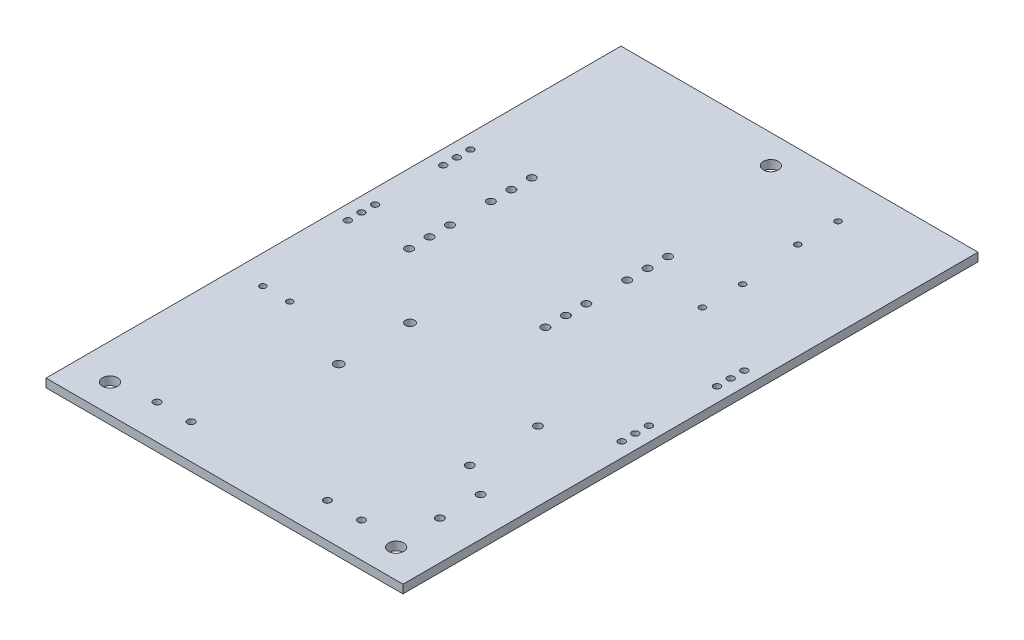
from build123d import *

# Parameters (mm, degrees)
SKETCH1_W                = 66.548
SKETCH1_H                = 107.188
EXTRUDE1_DEPTH           = 1.5748
SKETCH2_R                = 1.397
MTGHOLES_DEPTH           = 64.102740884
SKETCH3_R                = 0.6604
TERMINALBLOCKHOLES_DEPTH = 64.102740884
SKETCH4_R                = 0.6223
MOSFETHOLES_DEPTH        = 64.102740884
SKETCH5_R                = 0.7239
TRANSFORMER_DEPTH        = 64.102740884
SKETCH6_R                = 0.5715
CAPACITORS_DEPTH         = 64.102740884
SKETCH8_R                = 0.7239
SKETCH8_R_2              = 0.8509
CUT_EXTRUDE3_DEPTH       = 64.102740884


with BuildPart() as part:
    # Sketch1 → Extrude1 (new body)
    with BuildSketch(Plane(origin=(0, 0, 0), x_dir=(1, 0, 0), z_dir=(0, 1, 0))):
        Rectangle(SKETCH1_W, SKETCH1_H)
    extrude(amount=EXTRUDE1_DEPTH)

    # Sketch2 → MtgHoles (cut, through all)
    with BuildSketch(Plane(origin=(0, 1.5748, 0), x_dir=(-1, 0, 0), z_dir=(0, 1, 0))):
        with Locations(Location((26.67, 48.26, 0), (0, 0, 90))):
            Circle(SKETCH2_R)
        with Locations(Location((-26.67, 48.26, 0), (0, 0, 90))):
            Circle(SKETCH2_R)
        with Locations(Location((0, -48.26, 0), (0, 0, 90))):
            Circle(SKETCH2_R)
    extrude(amount=-MTGHOLES_DEPTH, mode=Mode.SUBTRACT)

    # Sketch3 → TerminalBlockHoles (cut, through all)
    with BuildSketch(Plane(origin=(0, 1.5748, 0), x_dir=(-1, 0, 0), z_dir=(0, 1, 0))):
        with Locations(Location((-19.05, 47.117, 0), (0, 0, 90))):
            Circle(SKETCH3_R)
        with Locations(Location((-12.7, 47.117, 0), (0, 0, 90))):
            Circle(SKETCH3_R)
        with Locations(Location((12.7, 47.117, 0), (0, 0, 270))):
            Circle(SKETCH3_R)
        with Locations(Location((19.05, 47.117, 0), (0, 0, 270))):
            Circle(SKETCH3_R)
    extrude(amount=-TERMINALBLOCKHOLES_DEPTH, mode=Mode.SUBTRACT)

    # Sketch4 → MosfetHoles (cut, through all)
    with BuildSketch(Plane(origin=(0, 1.5748, 0), x_dir=(-1, 0, 0), z_dir=(0, 1, 0))):
        with Locations(Location((-30.607, 10.16, 0), (0, 0, 90))):
            Circle(SKETCH4_R)
        with Locations(Location((-30.607, 5.08, 0), (0, 0, 90))):
            Circle(SKETCH4_R)
        with Locations(Location((-30.607, 7.62, 0), (0, 0, 90))):
            Circle(SKETCH4_R)
        with Locations(Location((-30.607, -7.62, 0), (0, 0, 90))):
            Circle(SKETCH4_R)
        with Locations(Location((-30.607, -12.7, 0), (0, 0, 90))):
            Circle(SKETCH4_R)
        with Locations(Location((-30.607, -10.16, 0), (0, 0, 90))):
            Circle(SKETCH4_R)
        with Locations(Location((30.607, 0, 0), (0, 0, 90))):
            Circle(SKETCH4_R)
        with Locations(Location((30.607, -5.08, 0), (0, 0, 90))):
            Circle(SKETCH4_R)
        with Locations(Location((30.607, -2.54, 0), (0, 0, 90))):
            Circle(SKETCH4_R)
        with Locations(Location((30.607, -17.78, 0), (0, 0, 90))):
            Circle(SKETCH4_R)
        with Locations(Location((30.607, -22.86, 0), (0, 0, 90))):
            Circle(SKETCH4_R)
        with Locations(Location((30.607, -20.32, 0), (0, 0, 90))):
            Circle(SKETCH4_R)
    extrude(amount=-MOSFETHOLES_DEPTH, mode=Mode.SUBTRACT)

    # Sketch5 → Transformer (cut, through all)
    with BuildSketch(Plane(origin=(0, 1.5748, 0), x_dir=(1, 0, 0), z_dir=(0, 1, 0))):
        with Locations(Location((-20.32, 24.003, 0), (0, 0, 270))):
            Circle(SKETCH5_R)
        with Locations(Location((-20.32, 20.193, 0), (0, 0, 270))):
            Circle(SKETCH5_R)
        with Locations(Location((-20.32, 16.383, 0), (0, 0, 270))):
            Circle(SKETCH5_R)
        with Locations(Location((-20.32, 8.763, 0), (0, 0, 270))):
            Circle(SKETCH5_R)
        with Locations(Location((-20.32, 4.953, 0), (0, 0, 270))):
            Circle(SKETCH5_R)
        with Locations(Location((-20.32, 1.143, 0), (0, 0, 270))):
            Circle(SKETCH5_R)
        with Locations(Location((5.08, 24.003, 0), (0, 0, 270))):
            Circle(SKETCH5_R)
        with Locations(Location((5.08, 20.193, 0), (0, 0, 270))):
            Circle(SKETCH5_R)
        with Locations(Location((5.08, 16.383, 0), (0, 0, 270))):
            Circle(SKETCH5_R)
        with Locations(Location((5.08, 8.763, 0), (0, 0, 270))):
            Circle(SKETCH5_R)
        with Locations(Location((5.08, 4.953, 0), (0, 0, 270))):
            Circle(SKETCH5_R)
        with Locations(Location((5.08, 1.143, 0), (0, 0, 270))):
            Circle(SKETCH5_R)
    extrude(amount=-TRANSFORMER_DEPTH, mode=Mode.SUBTRACT)

    # Sketch6 → Capacitors (cut, through all)
    with BuildSketch(Plane(origin=(0, 1.5748, 0), x_dir=(1, 0, 0), z_dir=(0, 1, 0))):
        with Locations(Location((16.51, 18.9829948, 0), (0, 0, 270))):
            Circle(SKETCH6_R)
        with Locations(Location((16.51, 26.4829948, 0), (0, 0, 270))):
            Circle(SKETCH6_R)
        with Locations(Location((15.24, 38.0329948, 0), (0, 0, 270))):
            Circle(SKETCH6_R)
        with Locations(Location((15.24, 45.5329948, 0), (0, 0, 270))):
            Circle(SKETCH6_R)
        with Locations(Location((-27.899995, -18.542, 0), (0, 0, 270))):
            Circle(SKETCH6_R)
        with Locations(Location((-22.899995, -18.542, 0), (0, 0, 270))):
            Circle(SKETCH6_R)
    extrude(amount=-CAPACITORS_DEPTH, mode=Mode.SUBTRACT)

    # Sketch8 → Cut-Extrude3 (cut, through all)
    with BuildSketch(Plane(origin=(0, 1.5748, 0), x_dir=(1, 0, 0), z_dir=(0, 1, 0))):
        with Locations(Location((20.32, -28.194, 0), (0, 0, 270))):
            Circle(SKETCH8_R)
        with Locations(Location((20.32, -15.494, 0), (0, 0, 270))):
            Circle(SKETCH8_R)
        with Locations(Location((26.035, -39.497, 0), (0, 0, 270))):
            Circle(SKETCH8_R)
        with Locations(Location((26.035, -31.877, 0), (0, 0, 270))):
            Circle(SKETCH8_R)
        with Locations(Location((-8.255, -24.0489994, 0), (0, 0, 270))):
            Circle(SKETCH8_R_2)
        with Locations(Location((-8.255, -10.7490006, 0), (0, 0, 270))):
            Circle(SKETCH8_R_2)
    extrude(amount=-CUT_EXTRUDE3_DEPTH, mode=Mode.SUBTRACT)


solid = part.part
